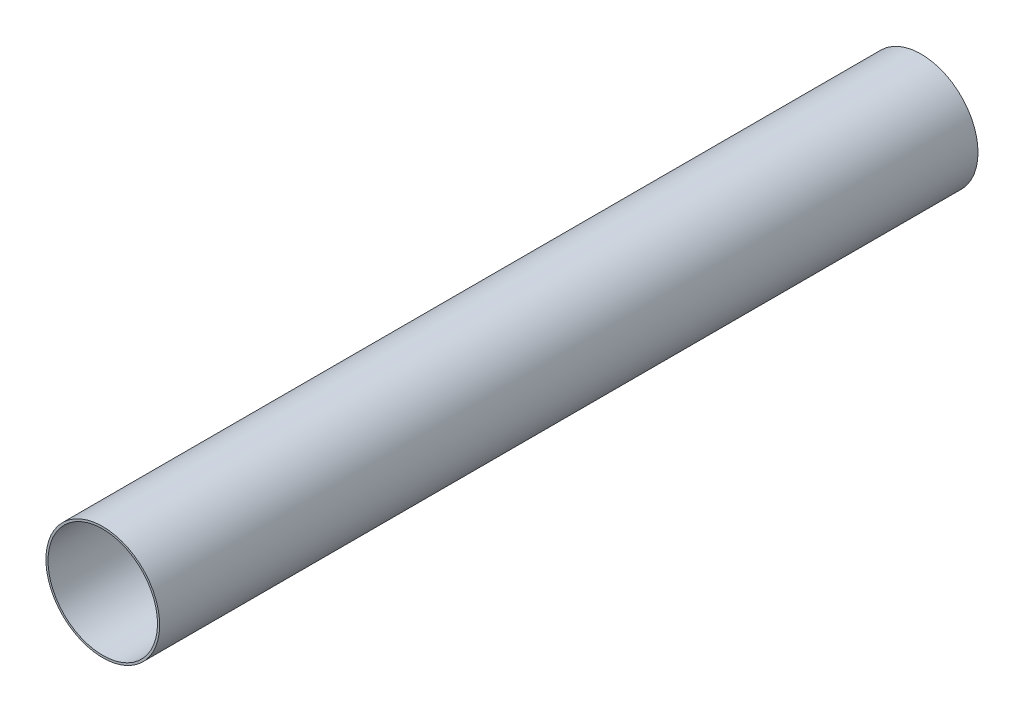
ISO-10303-21;
HEADER;
FILE_DESCRIPTION(('STEP AP214'),'2;1');
FILE_NAME('part.step','',(''),(''),'','','');
FILE_SCHEMA(('AUTOMOTIVE_DESIGN { 1 0 10303 214 1 1 1 1 }'));
ENDSEC;
DATA;
#1=APPLICATION_CONTEXT('core data for automotive mechanical design processes');
#2=APPLICATION_PROTOCOL_DEFINITION('international standard','automotive_design',2000,#1);
#3=PRODUCT_CONTEXT('',#1,'mechanical');
#4=PRODUCT('Part','Part','',(#3));
#5=PRODUCT_RELATED_PRODUCT_CATEGORY('part','',(#4));
#6=PRODUCT_DEFINITION_FORMATION('','',#4);
#7=PRODUCT_DEFINITION_CONTEXT('part definition',#1,'design');
#8=PRODUCT_DEFINITION('design','',#6,#7);
#9=PRODUCT_DEFINITION_SHAPE('','',#8);
#10=(LENGTH_UNIT() NAMED_UNIT(*) SI_UNIT(.MILLI.,.METRE.));
#11=(NAMED_UNIT(*) PLANE_ANGLE_UNIT() SI_UNIT($,.RADIAN.));
#12=(NAMED_UNIT(*) SI_UNIT($,.STERADIAN.) SOLID_ANGLE_UNIT());
#13=UNCERTAINTY_MEASURE_WITH_UNIT(LENGTH_MEASURE(1.E-05),#10,'distance_accuracy_value','');
#14=(GEOMETRIC_REPRESENTATION_CONTEXT(3) GLOBAL_UNCERTAINTY_ASSIGNED_CONTEXT((#13)) GLOBAL_UNIT_ASSIGNED_CONTEXT((#10,
#11,#12)) REPRESENTATION_CONTEXT('',''));
#15=CARTESIAN_POINT('',(0.,0.,0.));
#16=DIRECTION('',(0.,0.,1.));
#17=DIRECTION('',(1.,0.,0.));
#18=AXIS2_PLACEMENT_3D('',#15,#16,#17);
#19=CARTESIAN_POINT('',(0.,0.,-500.));
#20=DIRECTION('',(0.,0.,1.));
#21=DIRECTION('',(1.,0.,0.));
#22=AXIS2_PLACEMENT_3D('',#19,#20,#21);
#23=CYLINDRICAL_SURFACE('',#22,69.5);
#24=CARTESIAN_POINT('',(0.,0.,-500.));
#25=DIRECTION('',(0.,0.,1.));
#26=DIRECTION('',(1.,0.,0.));
#27=AXIS2_PLACEMENT_3D('',#24,#25,#26);
#28=CIRCLE('',#27,69.5);
#29=CARTESIAN_POINT('',(69.5,0.,-500.));
#30=VERTEX_POINT('',#29);
#31=EDGE_CURVE('E11',#30,#30,#28,.T.);
#32=ORIENTED_EDGE('',*,*,#31,.T.);
#33=EDGE_LOOP('',(#32));
#34=FACE_BOUND('',#33,.T.);
#35=CARTESIAN_POINT('',(0.,0.,500.));
#36=DIRECTION('',(0.,0.,1.));
#37=DIRECTION('',(1.,0.,0.));
#38=AXIS2_PLACEMENT_3D('',#35,#36,#37);
#39=CIRCLE('',#38,69.5);
#40=CARTESIAN_POINT('',(69.5,0.,500.));
#41=VERTEX_POINT('',#40);
#42=EDGE_CURVE('E42',#41,#41,#39,.T.);
#43=ORIENTED_EDGE('',*,*,#42,.F.);
#44=EDGE_LOOP('',(#43));
#45=FACE_BOUND('',#44,.T.);
#46=ADVANCED_FACE('F39',(#34,#45),#23,.T.);
#47=CARTESIAN_POINT('',(0.,0.,-500.));
#48=DIRECTION('',(0.,0.,1.));
#49=DIRECTION('',(1.,0.,0.));
#50=AXIS2_PLACEMENT_3D('',#47,#48,#49);
#51=PLANE('',#50);
#52=CARTESIAN_POINT('',(0.,0.,-500.));
#53=DIRECTION('',(0.,0.,1.));
#54=DIRECTION('',(1.,0.,0.));
#55=AXIS2_PLACEMENT_3D('',#52,#53,#54);
#56=CIRCLE('',#55,66.9);
#57=CARTESIAN_POINT('',(66.9,0.,-500.));
#58=VERTEX_POINT('',#57);
#59=EDGE_CURVE('E49',#58,#58,#56,.T.);
#60=ORIENTED_EDGE('',*,*,#59,.T.);
#61=EDGE_LOOP('',(#60));
#62=FACE_BOUND('',#61,.T.);
#63=ORIENTED_EDGE('',*,*,#31,.F.);
#64=EDGE_LOOP('',(#63));
#65=FACE_BOUND('',#64,.T.);
#66=ADVANCED_FACE('F57',(#62,#65),#51,.F.);
#67=CARTESIAN_POINT('',(0.,0.,500.));
#68=DIRECTION('',(0.,0.,1.));
#69=DIRECTION('',(1.,0.,0.));
#70=AXIS2_PLACEMENT_3D('',#67,#68,#69);
#71=PLANE('',#70);
#72=CARTESIAN_POINT('',(0.,0.,500.));
#73=DIRECTION('',(0.,0.,1.));
#74=DIRECTION('',(1.,0.,0.));
#75=AXIS2_PLACEMENT_3D('',#72,#73,#74);
#76=CIRCLE('',#75,66.9);
#77=CARTESIAN_POINT('',(66.9,0.,500.));
#78=VERTEX_POINT('',#77);
#79=EDGE_CURVE('E51',#78,#78,#76,.T.);
#80=ORIENTED_EDGE('',*,*,#79,.F.);
#81=EDGE_LOOP('',(#80));
#82=FACE_BOUND('',#81,.T.);
#83=ORIENTED_EDGE('',*,*,#42,.T.);
#84=EDGE_LOOP('',(#83));
#85=FACE_BOUND('',#84,.T.);
#86=ADVANCED_FACE('F63',(#82,#85),#71,.T.);
#87=CARTESIAN_POINT('',(0.,0.,-500.));
#88=DIRECTION('',(0.,0.,1.));
#89=DIRECTION('',(1.,0.,0.));
#90=AXIS2_PLACEMENT_3D('',#87,#88,#89);
#91=CYLINDRICAL_SURFACE('',#90,66.9);
#92=ORIENTED_EDGE('',*,*,#59,.F.);
#93=EDGE_LOOP('',(#92));
#94=FACE_BOUND('',#93,.T.);
#95=ORIENTED_EDGE('',*,*,#79,.T.);
#96=EDGE_LOOP('',(#95));
#97=FACE_BOUND('',#96,.T.);
#98=ADVANCED_FACE('F60',(#94,#97),#91,.F.);
#99=CLOSED_SHELL('',(#46,#66,#86,#98));
#100=MANIFOLD_SOLID_BREP('B2',#99);
#101=ADVANCED_BREP_SHAPE_REPRESENTATION('',(#18,#100),#14);
#102=SHAPE_DEFINITION_REPRESENTATION(#9,#101);
ENDSEC;
END-ISO-10303-21;
